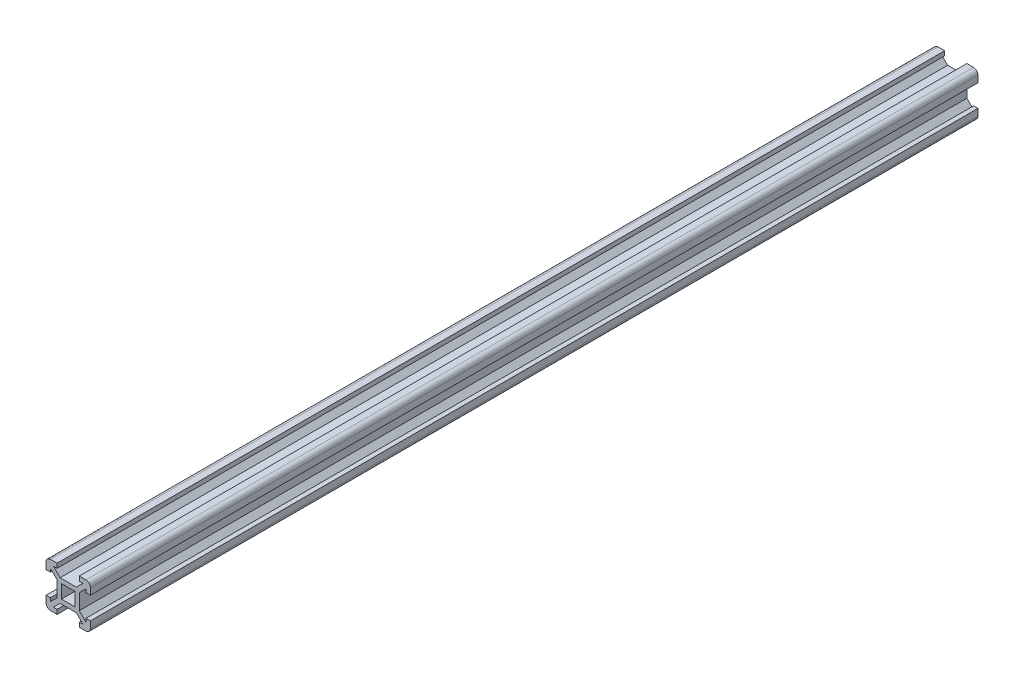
from build123d import *

# Parameters (mm, degrees)
ESQUISSE1_W      = 6.085415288
ESQUISSE1_H      = 6.085415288
EXTRUSION1_DEPTH = 400


with BuildPart() as part:
    # Esquisse1 → Extrusion1 (new body)
    with BuildSketch(Plane.XY):
        with BuildLine():
            Line((5, 13.522668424), (5, 6.477331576))
            Line((5, 6.477331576), (2, 3.521413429))
            Line((2, 3.521413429), (2, 5))
            Line((2, 5), (0, 5))
            Line((0, 5), (0, 2))
            ThreePointArc((0, 2), (0.585786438, 0.585786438), (2, 0))
            Line((2, 0), (5, 0))
            Line((5, 0), (5, 2))
            Line((5, 2), (3.305493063, 2))
            Line((3.305493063, 2), (6.350232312, 5))
            Line((6.350232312, 5), (13.649767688, 5))
            Line((13.649767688, 5), (16.694506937, 2))
            Line((16.694506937, 2), (15, 2))
            Line((15, 2), (15, 0))
            Line((15, 0), (18, 0))
            ThreePointArc((18, 0), (19.414213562, 0.585786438), (20, 2))
            Line((20, 2), (20, 5))
            Line((20, 5), (18, 5))
            Line((18, 5), (18, 3.521413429))
            Line((18, 3.521413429), (15, 6.477331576))
            Line((15, 6.477331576), (15, 13.522668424))
            Line((15, 13.522668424), (18, 16.478586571))
            Line((18, 16.478586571), (18, 15))
            Line((18, 15), (20, 15))
            Line((20, 15), (20, 18))
            ThreePointArc((20, 18), (19.414213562, 19.414213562), (18, 20))
            Line((18, 20), (15, 20))
            Line((15, 20), (15, 18))
            Line((15, 18), (16.694506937, 18))
            Line((16.694506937, 18), (13.649767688, 15))
            Line((13.649767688, 15), (6.350232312, 15))
            Line((6.350232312, 15), (3.305493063, 18))
            Line((3.305493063, 18), (5, 18))
            Line((5, 18), (5, 20))
            Line((5, 20), (2, 20))
            ThreePointArc((2, 20), (0.585786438, 19.414213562), (0, 18))
            Line((0, 18), (0, 15))
            Line((0, 15), (2, 15))
            Line((2, 15), (2, 16.478586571))
            Line((2, 16.478586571), (5, 13.522668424))
        make_face()
        with Locations((10, 10)):
            Rectangle(ESQUISSE1_W, ESQUISSE1_H, mode=Mode.SUBTRACT)
    extrude(amount=EXTRUSION1_DEPTH)


solid = part.part
